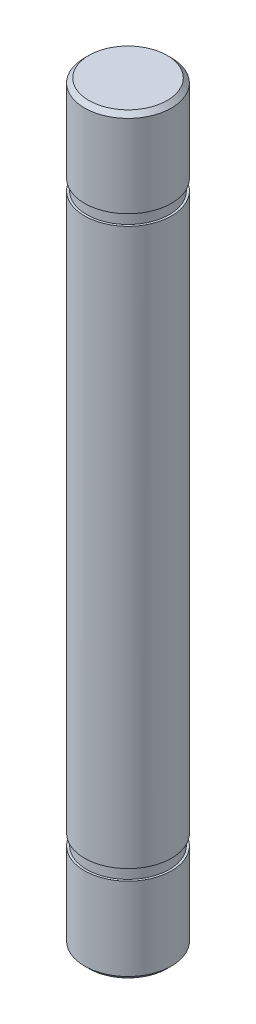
from build123d import *

# Parameters (mm, degrees)
SKETCH1_W     = 2
SKETCH1_H     = 34.6
CHAMFER1_SIZE = 0.2
SKETCH2_W     = 0.1
SKETCH2_H     = 0.5
SKETCH3_W     = 0.1
SKETCH3_H     = 0.5


with BuildPart() as part:
    # Sketch1 → Revolve1 (revolve)
    with BuildSketch(Plane.XY, mode=Mode.PRIVATE) as revolve1_sk:
        with Locations((1, 17.3)):
            Rectangle(SKETCH1_W, SKETCH1_H)
    revolve(revolve1_sk.sketch.rotate(Axis((0, 0, 0), (0, 1, 0)), 90), axis=Axis((0, 0, 0), (0, 1, 0)))

    # Chamfer1
    chamfer1_edges = [part.edges().sort_by_distance(p)[0] for p in [
        (0, 0, 2),
        (0, 34.6, 2),
    ]]
    chamfer(chamfer1_edges, length=CHAMFER1_SIZE)

    # Sketch2 → Cut-Revolve1 (revolve, cut)
    with BuildSketch(Plane.XY, mode=Mode.PRIVATE) as cut_revolve1_sk:
        with Locations((1.95, 4.25)):
            Rectangle(SKETCH2_W, SKETCH2_H)
    revolve(cut_revolve1_sk.sketch.rotate(Axis((0, 0, 0), (0, 1, 0)), 90), axis=Axis((0, 0, 0), (0, 1, 0)), mode=Mode.SUBTRACT)

    # Sketch3 → Cut-Revolve2 (revolve, cut)
    with BuildSketch(Plane.XY, mode=Mode.PRIVATE) as cut_revolve2_sk:
        with Locations((1.95, 30.35)):
            Rectangle(SKETCH3_W, SKETCH3_H)
    revolve(cut_revolve2_sk.sketch.rotate(Axis((0, 43.654136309, 0), (0, -1, 0)), 90), axis=Axis((0, 43.654136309, 0), (0, -1, 0)), mode=Mode.SUBTRACT)


solid = part.part
